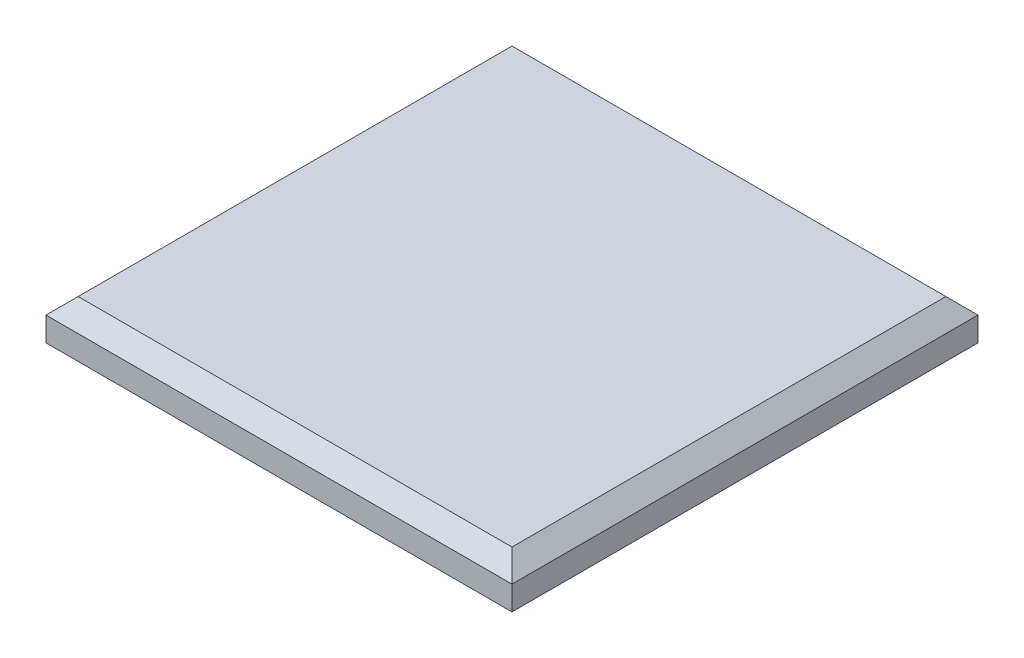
ISO-10303-21;
HEADER;
FILE_DESCRIPTION(('STEP AP214'),'2;1');
FILE_NAME('part.step','',(''),(''),'','','');
FILE_SCHEMA(('AUTOMOTIVE_DESIGN { 1 0 10303 214 1 1 1 1 }'));
ENDSEC;
DATA;
#1=APPLICATION_CONTEXT('core data for automotive mechanical design processes');
#2=APPLICATION_PROTOCOL_DEFINITION('international standard','automotive_design',2000,#1);
#3=PRODUCT_CONTEXT('',#1,'mechanical');
#4=PRODUCT('Part','Part','',(#3));
#5=PRODUCT_RELATED_PRODUCT_CATEGORY('part','',(#4));
#6=PRODUCT_DEFINITION_FORMATION('','',#4);
#7=PRODUCT_DEFINITION_CONTEXT('part definition',#1,'design');
#8=PRODUCT_DEFINITION('design','',#6,#7);
#9=PRODUCT_DEFINITION_SHAPE('','',#8);
#10=(LENGTH_UNIT() NAMED_UNIT(*) SI_UNIT(.MILLI.,.METRE.));
#11=(NAMED_UNIT(*) PLANE_ANGLE_UNIT() SI_UNIT($,.RADIAN.));
#12=(NAMED_UNIT(*) SI_UNIT($,.STERADIAN.) SOLID_ANGLE_UNIT());
#13=UNCERTAINTY_MEASURE_WITH_UNIT(LENGTH_MEASURE(1.E-05),#10,'distance_accuracy_value','');
#14=(GEOMETRIC_REPRESENTATION_CONTEXT(3) GLOBAL_UNCERTAINTY_ASSIGNED_CONTEXT((#13)) GLOBAL_UNIT_ASSIGNED_CONTEXT((#10,
#11,#12)) REPRESENTATION_CONTEXT('',''));
#15=CARTESIAN_POINT('',(0.,0.,0.));
#16=DIRECTION('',(0.,0.,1.));
#17=DIRECTION('',(1.,0.,0.));
#18=AXIS2_PLACEMENT_3D('',#15,#16,#17);
#19=CARTESIAN_POINT('',(-145.,25.,-290.));
#20=DIRECTION('',(1.,0.,0.));
#21=DIRECTION('',(0.,0.,-1.));
#22=AXIS2_PLACEMENT_3D('',#19,#20,#21);
#23=PLANE('',#22);
#24=DIRECTION('',(0.,-1.,0.));
#25=VECTOR('',#24,1.);
#26=CARTESIAN_POINT('',(-145.,25.,0.));
#27=LINE('',#26,#25);
#28=CARTESIAN_POINT('',(-145.,15.,0.));
#29=VERTEX_POINT('',#28);
#30=CARTESIAN_POINT('',(-145.,0.,0.));
#31=VERTEX_POINT('',#30);
#32=EDGE_CURVE('E86',#29,#31,#27,.T.);
#33=ORIENTED_EDGE('',*,*,#32,.F.);
#34=DIRECTION('',(0.,0.,-1.));
#35=VECTOR('',#34,1.);
#36=CARTESIAN_POINT('',(-145.,15.,-290.));
#37=LINE('',#36,#35);
#38=CARTESIAN_POINT('',(-145.,15.,-290.));
#39=VERTEX_POINT('',#38);
#40=EDGE_CURVE('E11',#29,#39,#37,.T.);
#41=ORIENTED_EDGE('',*,*,#40,.T.);
#42=DIRECTION('',(0.,-1.,0.));
#43=VECTOR('',#42,1.);
#44=CARTESIAN_POINT('',(-145.,25.,-290.));
#45=LINE('',#44,#43);
#46=CARTESIAN_POINT('',(-145.,0.,-290.));
#47=VERTEX_POINT('',#46);
#48=EDGE_CURVE('E106',#39,#47,#45,.T.);
#49=ORIENTED_EDGE('',*,*,#48,.T.);
#50=DIRECTION('',(0.,0.,1.));
#51=VECTOR('',#50,1.);
#52=CARTESIAN_POINT('',(-145.,0.,-290.));
#53=LINE('',#52,#51);
#54=EDGE_CURVE('E102',#47,#31,#53,.T.);
#55=ORIENTED_EDGE('',*,*,#54,.T.);
#56=EDGE_LOOP('',(#33,#41,#49,#55));
#57=FACE_BOUND('',#56,.T.);
#58=ADVANCED_FACE('F33',(#57),#23,.F.);
#59=CARTESIAN_POINT('',(-145.,25.,0.));
#60=DIRECTION('',(0.,0.,-1.));
#61=DIRECTION('',(-1.,0.,0.));
#62=AXIS2_PLACEMENT_3D('',#59,#60,#61);
#63=PLANE('',#62);
#64=DIRECTION('',(0.,-1.,0.));
#65=VECTOR('',#64,1.);
#66=CARTESIAN_POINT('',(145.,25.,0.));
#67=LINE('',#66,#65);
#68=CARTESIAN_POINT('',(145.,15.,0.));
#69=VERTEX_POINT('',#68);
#70=CARTESIAN_POINT('',(145.,0.,0.));
#71=VERTEX_POINT('',#70);
#72=EDGE_CURVE('E96',#69,#71,#67,.T.);
#73=ORIENTED_EDGE('',*,*,#72,.F.);
#74=DIRECTION('',(-1.,0.,0.));
#75=VECTOR('',#74,1.);
#76=CARTESIAN_POINT('',(-145.,15.,0.));
#77=LINE('',#76,#75);
#78=EDGE_CURVE('E93',#69,#29,#77,.T.);
#79=ORIENTED_EDGE('',*,*,#78,.T.);
#80=ORIENTED_EDGE('',*,*,#32,.T.);
#81=DIRECTION('',(1.,0.,0.));
#82=VECTOR('',#81,1.);
#83=CARTESIAN_POINT('',(-145.,0.,0.));
#84=LINE('',#83,#82);
#85=EDGE_CURVE('E90',#31,#71,#84,.T.);
#86=ORIENTED_EDGE('',*,*,#85,.T.);
#87=EDGE_LOOP('',(#73,#79,#80,#86));
#88=FACE_BOUND('',#87,.T.);
#89=ADVANCED_FACE('F89',(#88),#63,.F.);
#90=CARTESIAN_POINT('',(145.,25.,-290.));
#91=DIRECTION('',(-1.,0.,0.));
#92=DIRECTION('',(0.,0.,1.));
#93=AXIS2_PLACEMENT_3D('',#90,#91,#92);
#94=PLANE('',#93);
#95=DIRECTION('',(0.,-1.,0.));
#96=VECTOR('',#95,1.);
#97=CARTESIAN_POINT('',(145.,25.,-290.));
#98=LINE('',#97,#96);
#99=CARTESIAN_POINT('',(145.,15.,-290.));
#100=VERTEX_POINT('',#99);
#101=CARTESIAN_POINT('',(145.,0.,-290.));
#102=VERTEX_POINT('',#101);
#103=EDGE_CURVE('E116',#100,#102,#98,.T.);
#104=ORIENTED_EDGE('',*,*,#103,.F.);
#105=DIRECTION('',(0.,0.,1.));
#106=VECTOR('',#105,1.);
#107=CARTESIAN_POINT('',(145.,15.,0.));
#108=LINE('',#107,#106);
#109=EDGE_CURVE('E128',#100,#69,#108,.T.);
#110=ORIENTED_EDGE('',*,*,#109,.T.);
#111=ORIENTED_EDGE('',*,*,#72,.T.);
#112=DIRECTION('',(0.,0.,-1.));
#113=VECTOR('',#112,1.);
#114=CARTESIAN_POINT('',(145.,0.,-290.));
#115=LINE('',#114,#113);
#116=EDGE_CURVE('E104',#71,#102,#115,.T.);
#117=ORIENTED_EDGE('',*,*,#116,.T.);
#118=EDGE_LOOP('',(#104,#110,#111,#117));
#119=FACE_BOUND('',#118,.T.);
#120=ADVANCED_FACE('F164',(#119),#94,.F.);
#121=CARTESIAN_POINT('',(-145.,25.,-290.));
#122=DIRECTION('',(0.,0.,1.));
#123=DIRECTION('',(1.,0.,0.));
#124=AXIS2_PLACEMENT_3D('',#121,#122,#123);
#125=PLANE('',#124);
#126=ORIENTED_EDGE('',*,*,#48,.F.);
#127=DIRECTION('',(1.,0.,0.));
#128=VECTOR('',#127,1.);
#129=CARTESIAN_POINT('',(145.,15.,-290.));
#130=LINE('',#129,#128);
#131=EDGE_CURVE('E42',#39,#100,#130,.T.);
#132=ORIENTED_EDGE('',*,*,#131,.T.);
#133=ORIENTED_EDGE('',*,*,#103,.T.);
#134=DIRECTION('',(-1.,0.,0.));
#135=VECTOR('',#134,1.);
#136=CARTESIAN_POINT('',(-145.,0.,-290.));
#137=LINE('',#136,#135);
#138=EDGE_CURVE('E113',#102,#47,#137,.T.);
#139=ORIENTED_EDGE('',*,*,#138,.T.);
#140=EDGE_LOOP('',(#126,#132,#133,#139));
#141=FACE_BOUND('',#140,.T.);
#142=ADVANCED_FACE('F196',(#141),#125,.F.);
#143=CARTESIAN_POINT('',(0.,25.,0.));
#144=DIRECTION('',(0.,1.,0.));
#145=DIRECTION('',(0.,0.,1.));
#146=AXIS2_PLACEMENT_3D('',#143,#144,#145);
#147=PLANE('',#146);
#148=DIRECTION('',(0.,0.,1.));
#149=VECTOR('',#148,1.);
#150=CARTESIAN_POINT('',(-135.,25.,0.));
#151=LINE('',#150,#149);
#152=CARTESIAN_POINT('',(-135.,25.,-280.));
#153=VERTEX_POINT('',#152);
#154=CARTESIAN_POINT('',(-135.,25.,-9.99999999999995));
#155=VERTEX_POINT('',#154);
#156=EDGE_CURVE('E95',#153,#155,#151,.T.);
#157=ORIENTED_EDGE('',*,*,#156,.T.);
#158=DIRECTION('',(1.,0.,0.));
#159=VECTOR('',#158,1.);
#160=CARTESIAN_POINT('',(145.,25.,-9.99999999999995));
#161=LINE('',#160,#159);
#162=CARTESIAN_POINT('',(135.,25.,-9.99999999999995));
#163=VERTEX_POINT('',#162);
#164=EDGE_CURVE('E124',#155,#163,#161,.T.);
#165=ORIENTED_EDGE('',*,*,#164,.T.);
#166=DIRECTION('',(0.,0.,-1.));
#167=VECTOR('',#166,1.);
#168=CARTESIAN_POINT('',(135.,25.,-290.));
#169=LINE('',#168,#167);
#170=CARTESIAN_POINT('',(135.,25.,-280.));
#171=VERTEX_POINT('',#170);
#172=EDGE_CURVE('E122',#163,#171,#169,.T.);
#173=ORIENTED_EDGE('',*,*,#172,.T.);
#174=DIRECTION('',(-1.,0.,0.));
#175=VECTOR('',#174,1.);
#176=CARTESIAN_POINT('',(-145.,25.,-280.));
#177=LINE('',#176,#175);
#178=EDGE_CURVE('E120',#171,#153,#177,.T.);
#179=ORIENTED_EDGE('',*,*,#178,.T.);
#180=EDGE_LOOP('',(#157,#165,#173,#179));
#181=FACE_BOUND('',#180,.T.);
#182=ADVANCED_FACE('F146',(#181),#147,.T.);
#183=CARTESIAN_POINT('',(0.,0.,0.));
#184=DIRECTION('',(0.,1.,0.));
#185=DIRECTION('',(0.,0.,1.));
#186=AXIS2_PLACEMENT_3D('',#183,#184,#185);
#187=PLANE('',#186);
#188=ORIENTED_EDGE('',*,*,#54,.F.);
#189=ORIENTED_EDGE('',*,*,#138,.F.);
#190=ORIENTED_EDGE('',*,*,#116,.F.);
#191=ORIENTED_EDGE('',*,*,#85,.F.);
#192=EDGE_LOOP('',(#188,#189,#190,#191));
#193=FACE_BOUND('',#192,.T.);
#194=ADVANCED_FACE('F100',(#193),#187,.F.);
#195=CARTESIAN_POINT('',(0.,25.,-280.));
#196=DIRECTION('',(0.,0.707106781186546,-0.707106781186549));
#197=DIRECTION('',(1.,0.,0.));
#198=AXIS2_PLACEMENT_3D('',#195,#196,#197);
#199=PLANE('',#198);
#200=DIRECTION('',(0.577350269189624,-0.577350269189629,-0.577350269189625));
#201=VECTOR('',#200,1.);
#202=CARTESIAN_POINT('',(90.0000000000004,70.0000000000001,-235.));
#203=LINE('',#202,#201);
#204=EDGE_CURVE('E110',#100,#171,#203,.F.);
#205=ORIENTED_EDGE('',*,*,#204,.F.);
#206=ORIENTED_EDGE('',*,*,#131,.F.);
#207=DIRECTION('',(-0.577350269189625,-0.577350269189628,-0.577350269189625));
#208=VECTOR('',#207,1.);
#209=CARTESIAN_POINT('',(-41.6666666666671,118.333333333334,-186.666666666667));
#210=LINE('',#209,#208);
#211=EDGE_CURVE('E37',#153,#39,#210,.T.);
#212=ORIENTED_EDGE('',*,*,#211,.F.);
#213=ORIENTED_EDGE('',*,*,#178,.F.);
#214=EDGE_LOOP('',(#205,#206,#212,#213));
#215=FACE_BOUND('',#214,.T.);
#216=ADVANCED_FACE('F35',(#215),#199,.T.);
#217=CARTESIAN_POINT('',(-135.,25.,0.));
#218=DIRECTION('',(-0.707106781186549,0.707106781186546,0.));
#219=DIRECTION('',(0.,0.,-1.));
#220=AXIS2_PLACEMENT_3D('',#217,#218,#219);
#221=PLANE('',#220);
#222=ORIENTED_EDGE('',*,*,#211,.T.);
#223=ORIENTED_EDGE('',*,*,#40,.F.);
#224=DIRECTION('',(0.577350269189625,0.577350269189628,-0.577350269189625));
#225=VECTOR('',#224,1.);
#226=CARTESIAN_POINT('',(-138.333333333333,21.6666666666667,-6.66666666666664));
#227=LINE('',#226,#225);
#228=EDGE_CURVE('E133',#155,#29,#227,.F.);
#229=ORIENTED_EDGE('',*,*,#228,.F.);
#230=ORIENTED_EDGE('',*,*,#156,.F.);
#231=EDGE_LOOP('',(#222,#223,#229,#230));
#232=FACE_BOUND('',#231,.T.);
#233=ADVANCED_FACE('F152',(#232),#221,.T.);
#234=CARTESIAN_POINT('',(135.,25.,0.));
#235=DIRECTION('',(0.70710678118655,0.707106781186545,0.));
#236=DIRECTION('',(0.,0.,1.));
#237=AXIS2_PLACEMENT_3D('',#234,#235,#236);
#238=PLANE('',#237);
#239=ORIENTED_EDGE('',*,*,#204,.T.);
#240=ORIENTED_EDGE('',*,*,#172,.F.);
#241=DIRECTION('',(0.577350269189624,-0.577350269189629,0.577350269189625));
#242=VECTOR('',#241,1.);
#243=CARTESIAN_POINT('',(138.333333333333,21.6666666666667,-6.66666666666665));
#244=LINE('',#243,#242);
#245=EDGE_CURVE('E131',#69,#163,#244,.F.);
#246=ORIENTED_EDGE('',*,*,#245,.F.);
#247=ORIENTED_EDGE('',*,*,#109,.F.);
#248=EDGE_LOOP('',(#239,#240,#246,#247));
#249=FACE_BOUND('',#248,.T.);
#250=ADVANCED_FACE('F139',(#249),#238,.T.);
#251=CARTESIAN_POINT('',(0.,25.,-9.99999999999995));
#252=DIRECTION('',(0.,0.707106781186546,0.707106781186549));
#253=DIRECTION('',(-1.,0.,0.));
#254=AXIS2_PLACEMENT_3D('',#251,#252,#253);
#255=PLANE('',#254);
#256=ORIENTED_EDGE('',*,*,#228,.T.);
#257=ORIENTED_EDGE('',*,*,#78,.F.);
#258=ORIENTED_EDGE('',*,*,#245,.T.);
#259=ORIENTED_EDGE('',*,*,#164,.F.);
#260=EDGE_LOOP('',(#256,#257,#258,#259));
#261=FACE_BOUND('',#260,.T.);
#262=ADVANCED_FACE('F150',(#261),#255,.T.);
#263=CLOSED_SHELL('',(#58,#89,#120,#142,#182,#194,#216,#233,#250,#262));
#264=MANIFOLD_SOLID_BREP('B2',#263);
#265=ADVANCED_BREP_SHAPE_REPRESENTATION('',(#18,#264),#14);
#266=SHAPE_DEFINITION_REPRESENTATION(#9,#265);
ENDSEC;
END-ISO-10303-21;
